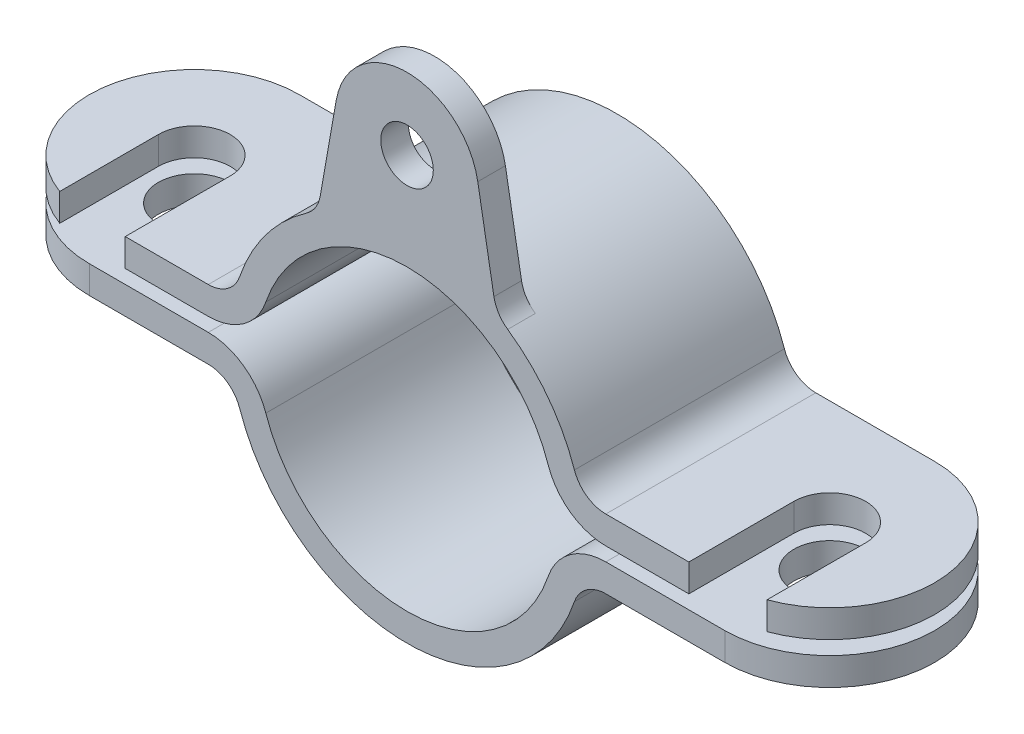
from build123d import *

# Parameters (mm, degrees)
MAIN_BODY_DEPTH           = 38
FULL_ROUND_FILLET1_RADIUS = 19
FULL_ROUND_FILLET1_LENGTH = 12.5
FULL_ROUND_FILLET2_RADIUS = 19
FULL_ROUND_FILLET2_LENGTH = 12.5
SKETCH2_R                 = 4.75
TAB_DEPTH                 = 5
FILLET1_R                 = 6
CUT_EXTRUDE1_DEPTH        = 103.968441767
SKETCH4_R                 = 6.5
CUT_EXTRUDE2_DEPTH        = 107.584766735
CUT_EXTRUDE3_DEPTH        = 100.613314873


with BuildPart() as part:
    # Sketch1 → Main Body (new body)
    with BuildSketch(Plane.XY):
        with BuildLine():
            Line((31.383713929, 6.25), (76.5, 6.25))
            Line((76.5, 6.25), (76.5, -6.25))
            Line((76.5, -6.25), (31.383713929, -6.25))
            ThreePointArc((31.383713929, -6.25), (0, -32), (-31.383713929, -6.25))
            Line((-31.383713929, -6.25), (-76.5, -6.25))
            Line((-76.5, -6.25), (-76.5, 6.25))
            Line((-76.5, 6.25), (-31.383713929, 6.25))
            ThreePointArc((-31.383713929, 6.25), (0, 32), (31.383713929, 6.25))
        make_face()
    extrude(amount=-MAIN_BODY_DEPTH)

    # Full Round Fillet1: full round fillet: the end face becomes a half cylinder, R = half its width
    full_round_fillet1_face = Plane((76.5, 0, -19), x_dir=(0, 1, 0), z_dir=(1, 0, 0))  # on the end face: x along it, z out of the body
    full_round_fillet1_slab = full_round_fillet1_face.offset(-FULL_ROUND_FILLET1_RADIUS / 2) * Box(FULL_ROUND_FILLET1_LENGTH, 2 * FULL_ROUND_FILLET1_RADIUS, FULL_ROUND_FILLET1_RADIUS, mode=Mode.PRIVATE)  # the body's end, R deep
    full_round_fillet1_round = Plane((57.5, 0, -19), x_dir=(1, 0, 0), z_dir=(0, 1, 0)) * Cylinder(FULL_ROUND_FILLET1_RADIUS, FULL_ROUND_FILLET1_LENGTH, mode=Mode.PRIVATE)  # its axis R under the face
    add(full_round_fillet1_slab - full_round_fillet1_round, mode=Mode.SUBTRACT)

    # Full Round Fillet2: full round fillet: the end face becomes a half cylinder, R = half its width
    full_round_fillet2_face = Plane((-76.5, 0, -19), x_dir=(0, -1, 0), z_dir=(-1, 0, 0))  # on the end face: x along it, z out of the body
    full_round_fillet2_slab = full_round_fillet2_face.offset(-FULL_ROUND_FILLET2_RADIUS / 2) * Box(FULL_ROUND_FILLET2_LENGTH, 2 * FULL_ROUND_FILLET2_RADIUS, FULL_ROUND_FILLET2_RADIUS, mode=Mode.PRIVATE)  # the body's end, R deep
    full_round_fillet2_round = Plane((-57.5, 0, -19), x_dir=(-1, 0, 0), z_dir=(0, -1, 0)) * Cylinder(FULL_ROUND_FILLET2_RADIUS, FULL_ROUND_FILLET2_LENGTH, mode=Mode.PRIVATE)  # its axis R under the face
    add(full_round_fillet2_slab - full_round_fillet2_round, mode=Mode.SUBTRACT)

    # Sketch2 → Tab (add)
    with BuildSketch(Plane.XY):
        with BuildLine():
            Line((-16.178931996, 27.608733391), (-12.802500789, 46.75742631))
            ThreePointArc((-12.802500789, 46.75742631), (0, 57.5), (12.802500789, 46.75742631))
            Line((12.802500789, 46.75742631), (16.178931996, 27.608733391))
            ThreePointArc((16.178931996, 27.608733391), (0, 32), (-16.178931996, 27.608733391))
        make_face()
        with Locations((0, 44.5)):
            Circle(SKETCH2_R, mode=Mode.SUBTRACT)
    extrude(amount=-TAB_DEPTH)

    # Fillet1
    fillet1_edges = [part.edges().sort_by_distance(p)[0] for p in [
        (31.383713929, 6.25, -19),
        (31.383713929, -6.25, -19),
        (-31.383713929, -6.25, -19),
        (-31.383713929, 6.25, -19),
        (16.178931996, 27.608733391, -2.5),
        (-16.178931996, 27.608733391, -2.5),
    ]]
    fillet(fillet1_edges, radius=FILLET1_R)

    # Sketch3 → Cut-Extrude1 (cut, through all)
    with BuildSketch(Plane.XY):
        with BuildLine():
            Line((-76.5, 1.25), (-76.5, -1.25))
            Line((-76.5, -1.25), (-35.971342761, -1.25))
            ThreePointArc((-35.971342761, -1.25), (-29.568475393, -3.305544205), (-25.558585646, -8.703947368))
            ThreePointArc((-25.558585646, -8.703947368), (0, -27), (25.558585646, -8.703947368))
            ThreePointArc((25.558585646, -8.703947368), (29.568475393, -3.305544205), (35.971342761, -1.25))
            Line((35.971342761, -1.25), (76.5, -1.25))
            Line((76.5, -1.25), (76.5, 1.25))
            Line((76.5, 1.25), (35.971342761, 1.25))
            ThreePointArc((35.971342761, 1.25), (29.568475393, 3.305544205), (25.558585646, 8.703947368))
            ThreePointArc((25.558585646, 8.703947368), (0, 27), (-25.558585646, 8.703947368))
            ThreePointArc((-25.558585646, 8.703947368), (-29.568475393, 3.305544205), (-35.971342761, 1.25))
            Line((-35.971342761, 1.25), (-76.5, 1.25))
        make_face()
    extrude(amount=-CUT_EXTRUDE1_DEPTH, mode=Mode.SUBTRACT)


with BuildPart() as cut_extrude1_piece_1:
    # of the separate pieces the step leaves, piece 1, a body of its own (cut_extrude1_pieces)
    add(part.part.solids().sort_by_distance((35.971342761, 6.25, 0))[0])

    # Sketch5 → Cut-Extrude3 (cut, through all)
    with BuildSketch(Plane(origin=(0, 6.25, 0), x_dir=(1, 0, 0), z_dir=(0, 1, 0))):
        with BuildLine():
            Line((-51, 19), (-51, 0))
            ThreePointArc((-51, 0), (-57.5, -6.5), (-64, 0))
            Line((-64, 0), (-64, 19))
            ThreePointArc((-64, 19), (-57.5, 25.5), (-51, 19))
        make_face()
        with BuildLine():
            Line((64, 19), (64, 0))
            ThreePointArc((64, 0), (57.5, -6.5), (51, 0))
            Line((51, 0), (51, 19))
            ThreePointArc((51, 19), (57.5, 25.5), (64, 19))
        make_face()
    extrude(amount=-CUT_EXTRUDE3_DEPTH, mode=Mode.SUBTRACT)


with BuildPart() as cut_extrude1_piece_2:
    # of the separate pieces the step leaves, piece 2, a body of its own (cut_extrude1_pieces)
    add(part.part.solids().sort_by_distance((-57.5, -1.25, 0))[0])

    # Sketch4 → Cut-Extrude2 (cut, through all)
    with BuildSketch(Plane.XZ.offset(6.25)):
        with Locations(Location((-57.5, -19, 0), (0, 0, 270))):
            Circle(SKETCH4_R)
        with Locations(Location((57.5, -19, 0), (0, 0, 270))):
            Circle(SKETCH4_R)
    extrude(amount=-CUT_EXTRUDE2_DEPTH, mode=Mode.SUBTRACT)


solid = Compound([cut_extrude1_piece_1.part, cut_extrude1_piece_2.part])
